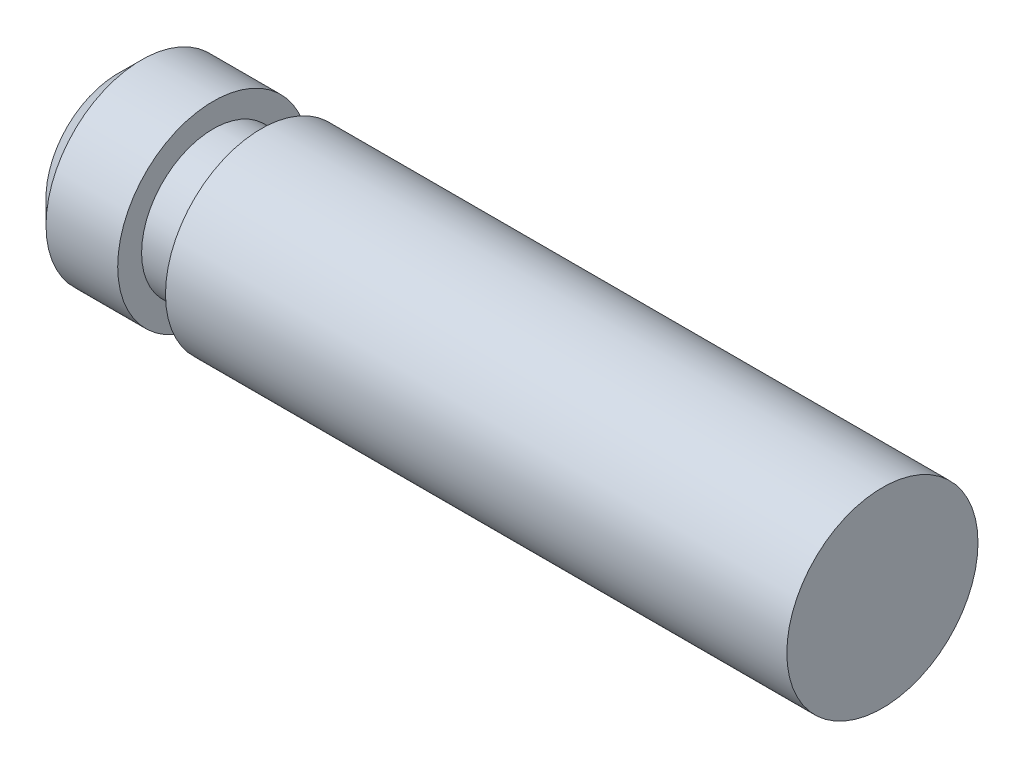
from build123d import *

# Parameters (mm, degrees)
CHANFREIN1_SIZE = 0.5


with BuildPart() as part:
    # Esquisse1 → R_volution1 (revolve)
    with BuildSketch(Plane.XY, mode=Mode.PRIVATE) as r_volution1_sk:
        Polygon((0, 0), (0, 2), (2, 2), (2, 1.5), (3, 1.5), (3, 2), (16, 2), (16, 0), align=None)
    revolve(r_volution1_sk.sketch.rotate(Axis((-29.010211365, 0, 0), (1, 0, 0)), 90), axis=Axis((-29.010211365, 0, 0), (1, 0, 0)))

    # Chanfrein1
    chanfrein1_edges = [part.edges().sort_by_distance(p)[0] for p in [
        (0, 0, -2),
    ]]
    chamfer(chanfrein1_edges, length=CHANFREIN1_SIZE)


solid = part.part
